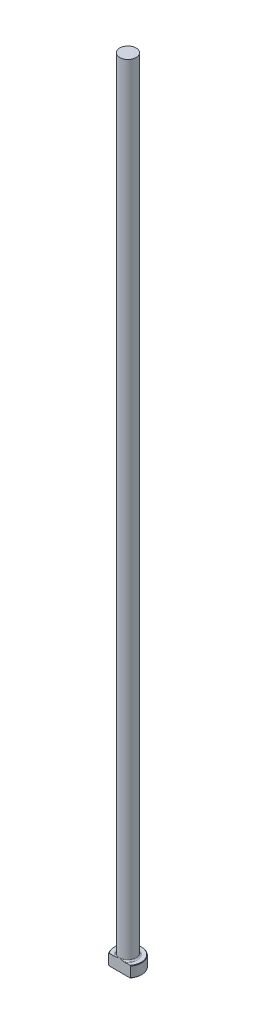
from build123d import *

# Parameters (mm, degrees)
CHAMFER1_SIZE = 0.254
FILLET1_R     = 0.762
KEY_DEPTH     = 458.337783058


with BuildPart() as part:
    # Sketch1 → Revolve1 (revolve)
    with BuildSketch(Plane.XY, mode=Mode.PRIVATE) as revolve1_sk:
        Polygon((0, 0), (-7.9375, 0), (-7.9375, 6.35), (-4.7625, 6.35), (-4.7625, 457.2), (0, 457.2), align=None)
    revolve(revolve1_sk.sketch.rotate(Axis((0, 259.958771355, 0), (0, -1, 0)), 270), axis=Axis((0, 259.958771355, 0), (0, -1, 0)))

    # Chamfer1
    chamfer1_edges = [part.edges().sort_by_distance(p)[0] for p in [
        (0, 6.35, -7.9375),
        (0, 0, -7.9375),
    ]]
    chamfer(chamfer1_edges, length=CHAMFER1_SIZE)

    # Fillet1
    fillet1_edges = [part.edges().sort_by_distance(p)[0] for p in [
        (0, 6.35, -4.7625),
    ]]
    fillet(fillet1_edges, radius=FILLET1_R)

    # Sketch2 → KEY (cut, through all)
    with BuildSketch(Plane.XZ):
        with BuildLine():
            Line((-6.35, 4.7625), (6.35, 4.7625))
            ThreePointArc((6.35, 4.7625), (0, 7.9375), (-6.35, 4.7625))
        make_face()
    extrude(amount=-KEY_DEPTH, mode=Mode.SUBTRACT)


solid = part.part
